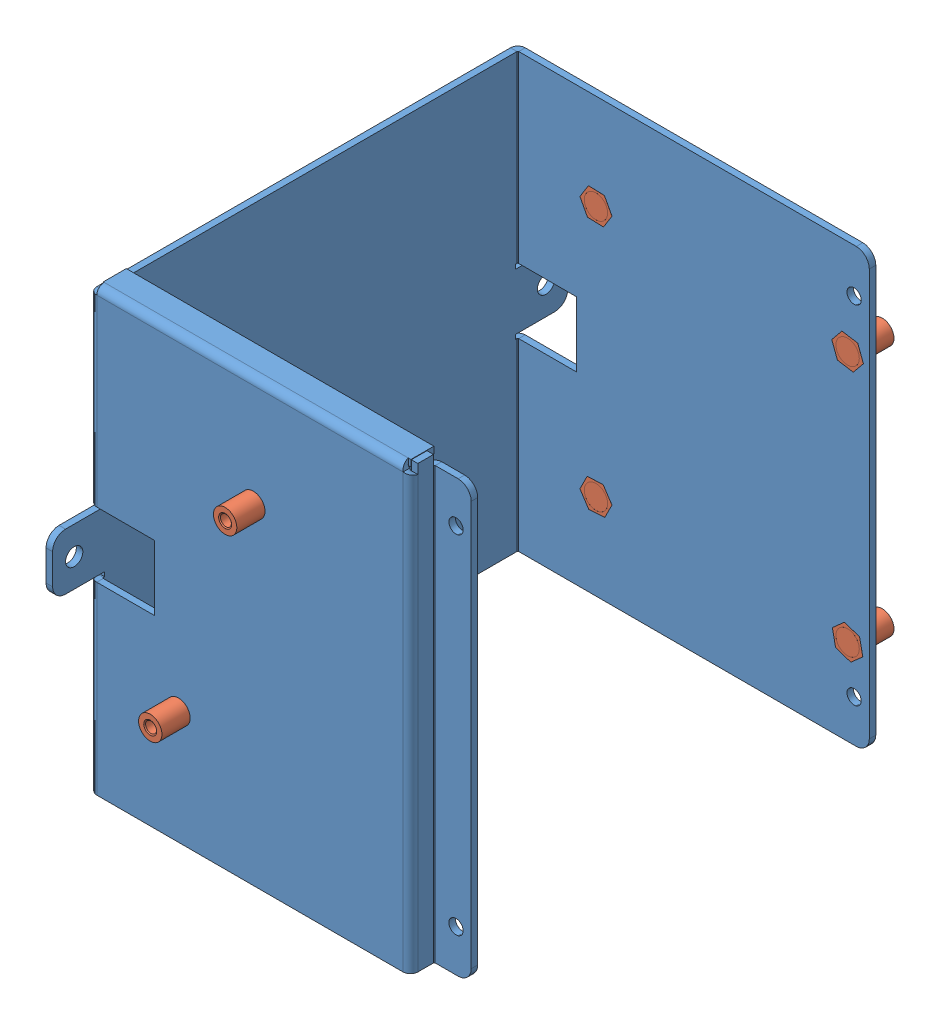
SolidWorks assembly N314JG01050111 钣金-AL5052-拉丝 通用散热器固定架.SLDASM, configuration 默认 (file format 9000). Lengths in mm.
Overall size (82.5 101.5 118.75).
7 component instances, 2 part files, 12 mates.
Components (placement in the parent):
- N314JG01050111_01 钣金-AL5052-拉丝 通用散热器固定架基体-1: N314JG01050111_01 钣金-AL5052-拉丝 通用散热器固定架基体.SLDPRT [默认] at (-40.5 0.3536 52.25) x (0 0 1) z (0 1 0) size (118.75 82.5 101.5)
- PEM BSO-3.5M3-8 ZI--N-1: PEM BSO-3.5M3-8 ZI--N.SLDPRT [默认] at (0 -29.8464 -44.9975) x (0.979471 0.201586 0) z (-0.201586 0.979471 0) size (6.4 8 7.39)
- PEM BSO-3.5M3-8 ZI--N-2: PEM BSO-3.5M3-8 ZI--N.SLDPRT [默认] at (0 28.1536 -44.9975) x (0.935119 0.354334 0) z (-0.354334 0.935119 0) size (6.4 8 7.39)
- PEM BSO-3.5M3-8 ZI--N-4: PEM BSO-3.5M3-8 ZI--N.SLDPRT [默认] at (-58 28.1536 -44.9975) x (0.882389 0.470521 0) z (-0.470521 0.882389 0) size (6.4 8 7.39)
- PEM BSO-3.5M3-8 ZI--N-6: PEM BSO-3.5M3-8 ZI--N.SLDPRT [默认] at (-58 -29.8464 -44.9975) x (0.834689 0.550721 0) z (-0.550721 0.834689 0) size (6.4 8 7.39)
- PEM BSO-3.5M3-8 ZI--N-8: PEM BSO-3.5M3-8 ZI--N.SLDPRT [默认] at (-39.7166 26.3762 50.7475) x (0.821776 -0.569811 0) z (-0.569811 -0.821776 0) size (6.4 8 7.39)
- PEM BSO-3.5M3-8 ZI--N-9: PEM BSO-3.5M3-8 ZI--N.SLDPRT [默认] at (-56.9782 -23.525 50.7475) x (0.821776 -0.569811 0) z (-0.569811 -0.821776 0) size (6.4 8 7.39)
Mates (geometry in assembly coordinates):
- 同心1: concentric anti-aligned: cylinder of N314JG01050111_01 钣金-AL5052-拉丝 通用散热器固定架基体-1 through (0 -29.8464 -45) axis (0 0 -1) radius 2.7; cylinder of PEM BSO-3.5M3-8 ZI--N-1 through (0 -29.8464 -52.9975) axis (0 0 1) radius 2.695
- 重合1: coincident aligned: plane of N314JG01050111_01 钣金-AL5052-拉丝 通用散热器固定架基体-1 through (-40.5 0.3536 -45) normal (0 0 1); plane of PEM BSO-3.5M3-8 ZI--N-1 through (-3.2211 -27.7249 -45) normal (0 0 1)
- 同心2: concentric anti-aligned: cylinder of N314JG01050111_01 钣金-AL5052-拉丝 通用散热器固定架基体-1 through (0 28.1536 -45) axis (0 0 -1) radius 2.7; cylinder of PEM BSO-3.5M3-8 ZI--N-2 through (0 28.1536 -52.9975) axis (0 0 1) radius 2.695
- 重合2: coincident aligned: plane of N314JG01050111_01 钣金-AL5052-拉丝 通用散热器固定架基体-1 through (-40.5 0.3536 -45) normal (0 0 1); plane of PEM BSO-3.5M3-8 ZI--N-2 through (-3.5168 29.7375 -45) normal (0 0 1)
- 同心3: concentric anti-aligned: cylinder of N314JG01050111_01 钣金-AL5052-拉丝 通用散热器固定架基体-1 through (-58 28.1536 -45) axis (0 0 -1) radius 2.7; cylinder of PEM BSO-3.5M3-8 ZI--N-4 through (-58 28.1536 -52.9975) axis (0 0 1) radius 2.695
- 重合3: coincident aligned: plane of N314JG01050111_01 钣金-AL5052-拉丝 通用散热器固定架基体-1 through (-40.5 0.3536 -45) normal (0 0 1); plane of PEM BSO-3.5M3-8 ZI--N-4 through (-61.6898 29.2769 -45) normal (0 0 1)
- 同心4: concentric anti-aligned: cylinder of N314JG01050111_01 钣金-AL5052-拉丝 通用散热器固定架基体-1 through (-58 -29.8464 -45) axis (0 0 -1) radius 2.7; cylinder of PEM BSO-3.5M3-8 ZI--N-6 through (-58 -29.8464 -52.9975) axis (0 0 1) radius 2.695
- 重合4: coincident aligned: plane of N314JG01050111_01 钣金-AL5052-拉丝 通用散热器固定架基体-1 through (-40.5 0.3536 -45) normal (0 0 1); plane of PEM BSO-3.5M3-8 ZI--N-6 through (-61.7785 -29.072 -45) normal (0 0 1)
- 同心5: concentric anti-aligned: cylinder of N314JG01050111_01 钣金-AL5052-拉丝 通用散热器固定架基体-1 through (-39.7166 26.3762 50.75) axis (0 0 1) radius 2.7; cylinder of PEM BSO-3.5M3-8 ZI--N-8 through (-39.7166 26.3762 58.7475) axis (0 0 -1) radius 2.695
- 重合5: coincident aligned: plane of N314JG01050111_01 钣金-AL5052-拉丝 通用散热器固定架基体-1 through (-40.5 0.3536 50.75) normal (0 0 -1); plane of PEM BSO-3.5M3-8 ZI--N-8 through (-43.5119 25.689 50.75) normal (0 0 -1)
- 同心6: concentric anti-aligned: cylinder of N314JG01050111_01 钣金-AL5052-拉丝 通用散热器固定架基体-1 through (-56.9782 -23.525 50.75) axis (0 0 1) radius 2.7; cylinder of PEM BSO-3.5M3-8 ZI--N-9 through (-56.9782 -23.525 58.7475) axis (0 0 -1) radius 2.695
- 重合6: coincident aligned: plane of N314JG01050111_01 钣金-AL5052-拉丝 通用散热器固定架基体-1 through (-40.5 0.3536 50.75) normal (0 0 -1); plane of PEM BSO-3.5M3-8 ZI--N-9 through (-60.7735 -24.2122 50.75) normal (0 0 -1)
